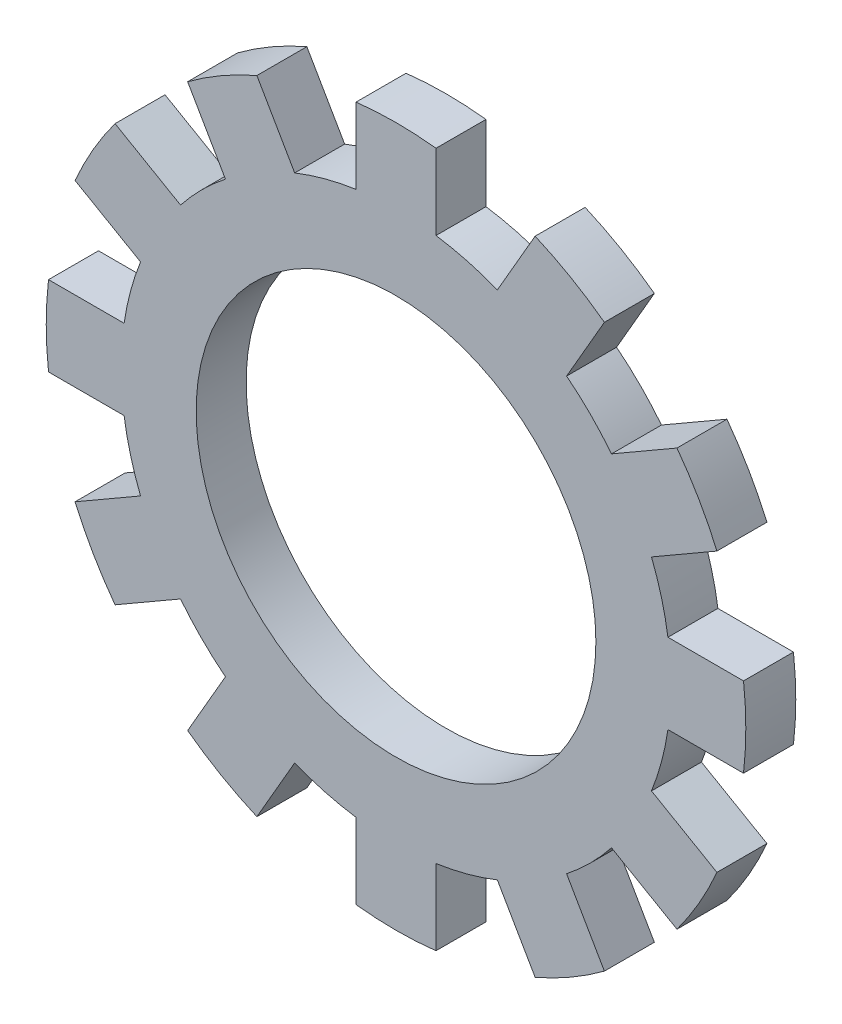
from build123d import *

# Parameters (mm, degrees)
SKETCH1_R                 = 2.75
SKETCH1_R_2               = 2
BOSS_EXTRUDE1_DEPTH       = 0.25
BOSS_EXTRUDE2_DEPTH       = 0.25
CIRPATTERN2_COUNT         = 12
CIRPATTERN2_COPY_1_DEPTH  = 0.25
CIRPATTERN2_COPY_2_DEPTH  = 0.25
CIRPATTERN2_COPY_3_DEPTH  = 0.25
CIRPATTERN2_COPY_4_DEPTH  = 0.25
CIRPATTERN2_COPY_5_DEPTH  = 0.25
CIRPATTERN2_COPY_6_DEPTH  = 0.25
CIRPATTERN2_COPY_7_DEPTH  = 0.25
CIRPATTERN2_COPY_8_DEPTH  = 0.25
CIRPATTERN2_COPY_9_DEPTH  = 0.25
CIRPATTERN2_COPY_10_DEPTH = 0.25
CIRPATTERN2_COPY_11_DEPTH = 0.25


with BuildPart() as part:
    # Sketch1 → Boss-Extrude1 (new, symmetric)
    with BuildSketch(Plane.XY):
        Circle(SKETCH1_R)
        Circle(SKETCH1_R_2, mode=Mode.SUBTRACT)
    extrude(amount=BOSS_EXTRUDE1_DEPTH, both=True)

    # Sketch3 → Boss-Extrude2 (add, symmetric)
    with BuildSketch(Plane.XY):
        with BuildLine():
            Line((-0.4, 3.47706773), (-0.4, 2.720753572))
            ThreePointArc((-0.4, 2.720753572), (-0.200533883, 2.742678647), (0, 2.75))
            Line((0, 2.75), (0, 3.5))
            ThreePointArc((0, 3.5), (-0.200328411, 3.494262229), (-0.4, 3.47706773))
        make_face()
    boss_extrude2 = extrude(amount=BOSS_EXTRUDE2_DEPTH, both=True)

    # Mirror1: Boss-Extrude2 across plane
    add(boss_extrude2.mirror(Plane(origin=(0, 0, 0), x_dir=(0, 0, 1), z_dir=(1, 0, 0))))

    # CirPattern2: Boss-Extrude2 ×12 about axis
    cirpattern2_axis = Axis((0, 0, 0), (0, 0, 1))
    for i in range(1, CIRPATTERN2_COUNT):
        add(boss_extrude2.rotate(cirpattern2_axis, i * 360 / CIRPATTERN2_COUNT))

    # CirPattern2 copy 1 sketch → CirPattern2 copy 1 (add, symmetric)
    with BuildSketch(Plane(origin=(0, 0, 0), x_dir=(-0.8660254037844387, -0.49999999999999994, 0), z_dir=(0, 0, 1))):
        with BuildLine():
            Line((-0.4, -3.47706773), (-0.4, -2.720753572))
            ThreePointArc((-0.4, -2.720753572), (-0.200533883, -2.742678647), (0, -2.75))
            Line((0, -2.75), (0, -3.5))
            ThreePointArc((0, -3.5), (-0.200328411, -3.494262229), (-0.4, -3.47706773))
        make_face()
    extrude(amount=CIRPATTERN2_COPY_1_DEPTH, both=True)

    # CirPattern2 copy 2 sketch → CirPattern2 copy 2 (add, symmetric)
    with BuildSketch(Plane(origin=(0, 0, 0), x_dir=(-0.5000000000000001, -0.8660254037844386, 0), z_dir=(0, 0, 1))):
        with BuildLine():
            Line((-0.4, -3.47706773), (-0.4, -2.720753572))
            ThreePointArc((-0.4, -2.720753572), (-0.200533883, -2.742678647), (0, -2.75))
            Line((0, -2.75), (0, -3.5))
            ThreePointArc((0, -3.5), (-0.200328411, -3.494262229), (-0.4, -3.47706773))
        make_face()
    extrude(amount=CIRPATTERN2_COPY_2_DEPTH, both=True)

    # CirPattern2 copy 3 sketch → CirPattern2 copy 3 (add, symmetric)
    with BuildSketch(Plane(origin=(0, 0, 0), x_dir=(0, -1, 0), z_dir=(0, 0, 1))):
        with BuildLine():
            Line((-0.4, -3.47706773), (-0.4, -2.720753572))
            ThreePointArc((-0.4, -2.720753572), (-0.200533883, -2.742678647), (0, -2.75))
            Line((0, -2.75), (0, -3.5))
            ThreePointArc((0, -3.5), (-0.200328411, -3.494262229), (-0.4, -3.47706773))
        make_face()
    extrude(amount=CIRPATTERN2_COPY_3_DEPTH, both=True)

    # CirPattern2 copy 4 sketch → CirPattern2 copy 4 (add, symmetric)
    with BuildSketch(Plane(origin=(0, 0, 0), x_dir=(0.4999999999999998, -0.8660254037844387, 0), z_dir=(0, 0, 1))):
        with BuildLine():
            Line((-0.4, -3.47706773), (-0.4, -2.720753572))
            ThreePointArc((-0.4, -2.720753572), (-0.200533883, -2.742678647), (0, -2.75))
            Line((0, -2.75), (0, -3.5))
            ThreePointArc((0, -3.5), (-0.200328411, -3.494262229), (-0.4, -3.47706773))
        make_face()
    extrude(amount=CIRPATTERN2_COPY_4_DEPTH, both=True)

    # CirPattern2 copy 5 sketch → CirPattern2 copy 5 (add, symmetric)
    with BuildSketch(Plane(origin=(0, 0, 0), x_dir=(0.8660254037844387, -0.49999999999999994, 0), z_dir=(0, 0, 1))):
        with BuildLine():
            Line((-0.4, -3.47706773), (-0.4, -2.720753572))
            ThreePointArc((-0.4, -2.720753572), (-0.200533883, -2.742678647), (0, -2.75))
            Line((0, -2.75), (0, -3.5))
            ThreePointArc((0, -3.5), (-0.200328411, -3.494262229), (-0.4, -3.47706773))
        make_face()
    extrude(amount=CIRPATTERN2_COPY_5_DEPTH, both=True)

    # CirPattern2 copy 6 sketch → CirPattern2 copy 6 (add, symmetric)
    with BuildSketch(Plane.XY):
        with BuildLine():
            Line((-0.4, -3.47706773), (-0.4, -2.720753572))
            ThreePointArc((-0.4, -2.720753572), (-0.200533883, -2.742678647), (0, -2.75))
            Line((0, -2.75), (0, -3.5))
            ThreePointArc((0, -3.5), (-0.200328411, -3.494262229), (-0.4, -3.47706773))
        make_face()
    extrude(amount=CIRPATTERN2_COPY_6_DEPTH, both=True)

    # CirPattern2 copy 7 sketch → CirPattern2 copy 7 (add, symmetric)
    with BuildSketch(Plane(origin=(0, 0, 0), x_dir=(0.8660254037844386, 0.5000000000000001, 0), z_dir=(0, 0, 1))):
        with BuildLine():
            Line((-0.4, -3.47706773), (-0.4, -2.720753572))
            ThreePointArc((-0.4, -2.720753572), (-0.200533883, -2.742678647), (0, -2.75))
            Line((0, -2.75), (0, -3.5))
            ThreePointArc((0, -3.5), (-0.200328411, -3.494262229), (-0.4, -3.47706773))
        make_face()
    extrude(amount=CIRPATTERN2_COPY_7_DEPTH, both=True)

    # CirPattern2 copy 8 sketch → CirPattern2 copy 8 (add, symmetric)
    with BuildSketch(Plane(origin=(0, 0, 0), x_dir=(0.5000000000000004, 0.8660254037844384, 0), z_dir=(0, 0, 1))):
        with BuildLine():
            Line((-0.4, -3.47706773), (-0.4, -2.720753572))
            ThreePointArc((-0.4, -2.720753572), (-0.200533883, -2.742678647), (0, -2.75))
            Line((0, -2.75), (0, -3.5))
            ThreePointArc((0, -3.5), (-0.200328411, -3.494262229), (-0.4, -3.47706773))
        make_face()
    extrude(amount=CIRPATTERN2_COPY_8_DEPTH, both=True)

    # CirPattern2 copy 9 sketch → CirPattern2 copy 9 (add, symmetric)
    with BuildSketch(Plane(origin=(0, 0, 0), x_dir=(0, 1, 0), z_dir=(0, 0, 1))):
        with BuildLine():
            Line((-0.4, -3.47706773), (-0.4, -2.720753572))
            ThreePointArc((-0.4, -2.720753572), (-0.200533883, -2.742678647), (0, -2.75))
            Line((0, -2.75), (0, -3.5))
            ThreePointArc((0, -3.5), (-0.200328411, -3.494262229), (-0.4, -3.47706773))
        make_face()
    extrude(amount=CIRPATTERN2_COPY_9_DEPTH, both=True)

    # CirPattern2 copy 10 sketch → CirPattern2 copy 10 (add, symmetric)
    with BuildSketch(Plane(origin=(0, 0, 0), x_dir=(-0.5000000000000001, 0.8660254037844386, 0), z_dir=(0, 0, 1))):
        with BuildLine():
            Line((-0.4, -3.47706773), (-0.4, -2.720753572))
            ThreePointArc((-0.4, -2.720753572), (-0.200533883, -2.742678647), (0, -2.75))
            Line((0, -2.75), (0, -3.5))
            ThreePointArc((0, -3.5), (-0.200328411, -3.494262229), (-0.4, -3.47706773))
        make_face()
    extrude(amount=CIRPATTERN2_COPY_10_DEPTH, both=True)

    # CirPattern2 copy 11 sketch → CirPattern2 copy 11 (add, symmetric)
    with BuildSketch(Plane(origin=(0, 0, 0), x_dir=(-0.8660254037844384, 0.5000000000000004, 0), z_dir=(0, 0, 1))):
        with BuildLine():
            Line((-0.4, -3.47706773), (-0.4, -2.720753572))
            ThreePointArc((-0.4, -2.720753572), (-0.200533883, -2.742678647), (0, -2.75))
            Line((0, -2.75), (0, -3.5))
            ThreePointArc((0, -3.5), (-0.200328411, -3.494262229), (-0.4, -3.47706773))
        make_face()
    extrude(amount=CIRPATTERN2_COPY_11_DEPTH, both=True)


solid = part.part
